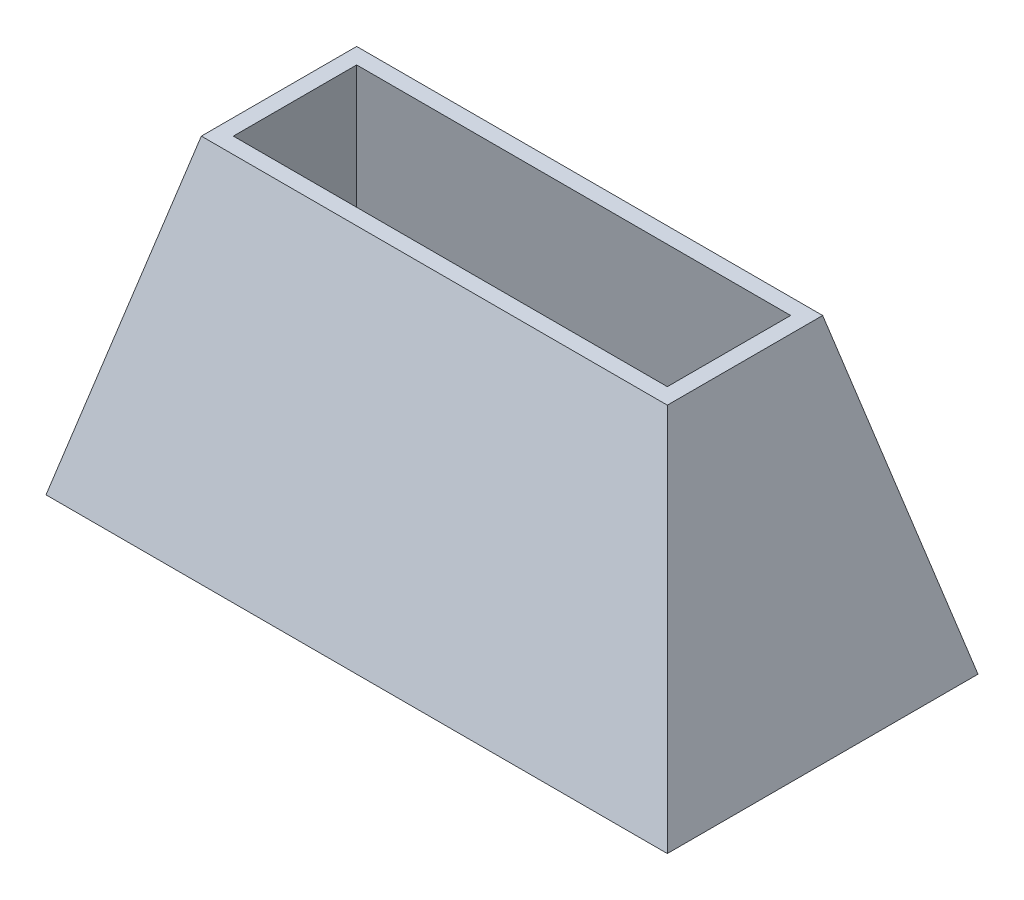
from build123d import *

# Parameters (mm, degrees)
SHELL1_T = -2.54


with BuildPart() as part:
    # Sketch4 → Loft1 section 0
    with BuildSketch(Plane(origin=(0, 0, 0), x_dir=(1, 0, 0), z_dir=(0, 1, 0))):
        with BuildLine():
            Line((-50.8, -25.4), (50.8, -25.4))
            Line((50.8, -25.4), (50.8, 25.4))
            Line((50.8, 25.4), (-50.8, 25.4))
            Line((-50.8, 25.4), (-50.8, -25.4))
        make_face()
    # Sketch5 → Loft1 section 1
    with BuildSketch(Plane(origin=(0, 50.8, 0), x_dir=(1, 0, 0), z_dir=(0, 1, 0))):
        with BuildLine():
            Line((-38.1, 12.7), (-38.1, -12.7))
            Line((-38.1, -12.7), (38.1, -12.7))
            Line((38.1, -12.7), (38.1, 12.7))
            Line((38.1, 12.7), (-38.1, 12.7))
        make_face()
    loft()

    # Shell1
    shell1_openings = [part.faces().sort_by_distance(p)[0] for p in [
        (0, 50.8, 0),
    ]]
    offset(amount=SHELL1_T, openings=shell1_openings, kind=Kind.INTERSECTION)


solid = part.part
